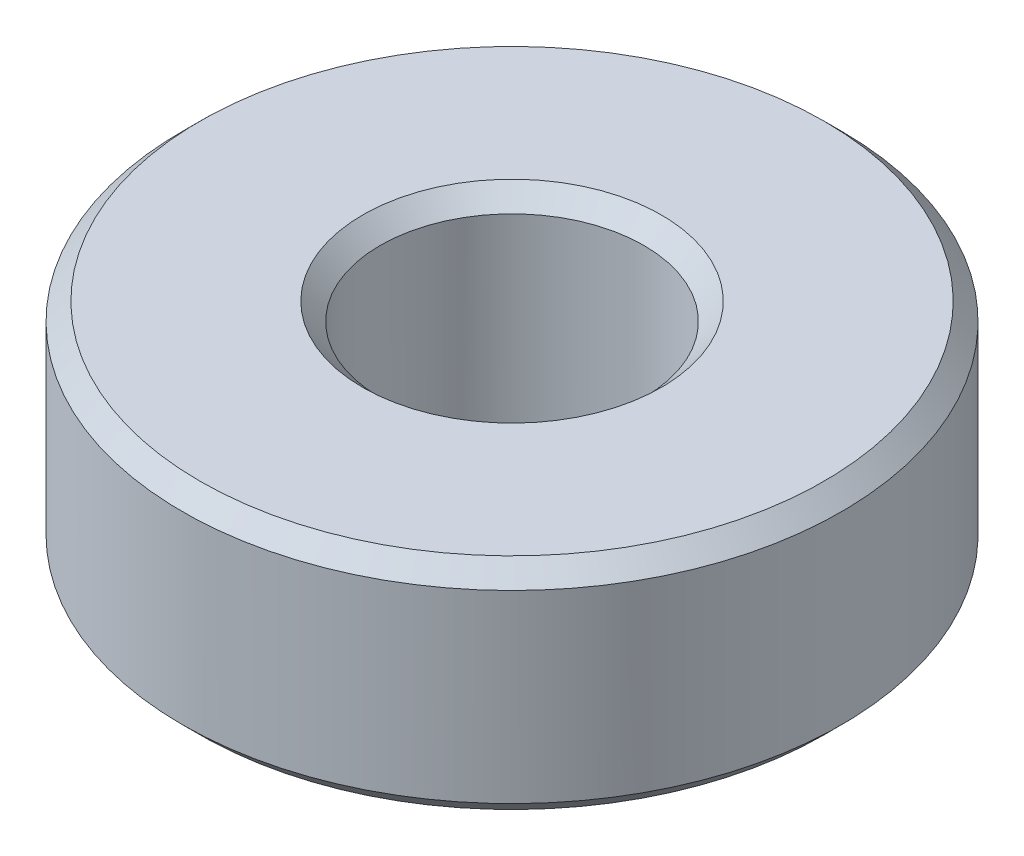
ISO-10303-21;
HEADER;
FILE_DESCRIPTION(('STEP AP214'),'2;1');
FILE_NAME('part.step','',(''),(''),'','','');
FILE_SCHEMA(('AUTOMOTIVE_DESIGN { 1 0 10303 214 1 1 1 1 }'));
ENDSEC;
DATA;
#1=APPLICATION_CONTEXT('core data for automotive mechanical design processes');
#2=APPLICATION_PROTOCOL_DEFINITION('international standard','automotive_design',2000,#1);
#3=PRODUCT_CONTEXT('',#1,'mechanical');
#4=PRODUCT('Part','Part','',(#3));
#5=PRODUCT_RELATED_PRODUCT_CATEGORY('part','',(#4));
#6=PRODUCT_DEFINITION_FORMATION('','',#4);
#7=PRODUCT_DEFINITION_CONTEXT('part definition',#1,'design');
#8=PRODUCT_DEFINITION('design','',#6,#7);
#9=PRODUCT_DEFINITION_SHAPE('','',#8);
#10=(LENGTH_UNIT() NAMED_UNIT(*) SI_UNIT(.MILLI.,.METRE.));
#11=(NAMED_UNIT(*) PLANE_ANGLE_UNIT() SI_UNIT($,.RADIAN.));
#12=(NAMED_UNIT(*) SI_UNIT($,.STERADIAN.) SOLID_ANGLE_UNIT());
#13=UNCERTAINTY_MEASURE_WITH_UNIT(LENGTH_MEASURE(1.E-05),#10,'distance_accuracy_value','');
#14=(GEOMETRIC_REPRESENTATION_CONTEXT(3) GLOBAL_UNCERTAINTY_ASSIGNED_CONTEXT((#13)) GLOBAL_UNIT_ASSIGNED_CONTEXT((#10,
#11,#12)) REPRESENTATION_CONTEXT('',''));
#15=CARTESIAN_POINT('',(0.,0.,0.));
#16=DIRECTION('',(0.,0.,1.));
#17=DIRECTION('',(1.,0.,0.));
#18=AXIS2_PLACEMENT_3D('',#15,#16,#17);
#19=CARTESIAN_POINT('',(0.,5.,0.));
#20=DIRECTION('',(0.,1.,0.));
#21=DIRECTION('',(0.,0.,1.));
#22=AXIS2_PLACEMENT_3D('',#19,#20,#21);
#23=PLANE('',#22);
#24=CARTESIAN_POINT('',(0.,5.,0.));
#25=DIRECTION('',(0.,-1.,0.));
#26=DIRECTION('',(0.,0.,-1.));
#27=AXIS2_PLACEMENT_3D('',#24,#25,#26);
#28=CIRCLE('',#27,7.09999999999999);
#29=CARTESIAN_POINT('',(0.,5.,-7.09999999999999));
#30=VERTEX_POINT('',#29);
#31=EDGE_CURVE('E32',#30,#30,#28,.T.);
#32=ORIENTED_EDGE('',*,*,#31,.F.);
#33=EDGE_LOOP('',(#32));
#34=FACE_BOUND('',#33,.T.);
#35=CARTESIAN_POINT('',(0.,5.0000000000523,0.));
#36=DIRECTION('',(0.,1.,0.));
#37=DIRECTION('',(0.,0.,1.));
#38=AXIS2_PLACEMENT_3D('',#35,#36,#37);
#39=CIRCLE('',#38,3.39999999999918);
#40=CARTESIAN_POINT('',(0.,5.0000000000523,3.39999999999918));
#41=VERTEX_POINT('',#40);
#42=EDGE_CURVE('E18',#41,#41,#39,.F.);
#43=ORIENTED_EDGE('',*,*,#42,.T.);
#44=EDGE_LOOP('',(#43));
#45=FACE_BOUND('',#44,.T.);
#46=ADVANCED_FACE('F15',(#34,#45),#23,.T.);
#47=CARTESIAN_POINT('',(0.,5.0000000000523,0.));
#48=DIRECTION('',(0.,1.,0.));
#49=DIRECTION('',(0.,0.,1.));
#50=AXIS2_PLACEMENT_3D('',#47,#48,#49);
#51=CONICAL_SURFACE('',#50,3.39999999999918,0.785398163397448);
#52=ORIENTED_EDGE('',*,*,#42,.F.);
#53=EDGE_LOOP('',(#52));
#54=FACE_BOUND('',#53,.T.);
#55=CARTESIAN_POINT('',(0.,4.6,0.));
#56=DIRECTION('',(0.,-1.,0.));
#57=DIRECTION('',(0.,0.,-1.));
#58=AXIS2_PLACEMENT_3D('',#55,#56,#57);
#59=CIRCLE('',#58,3.);
#60=CARTESIAN_POINT('',(0.,4.6,-3.));
#61=VERTEX_POINT('',#60);
#62=EDGE_CURVE('E30',#61,#61,#59,.T.);
#63=ORIENTED_EDGE('',*,*,#62,.T.);
#64=EDGE_LOOP('',(#63));
#65=FACE_BOUND('',#64,.T.);
#66=ADVANCED_FACE('F42',(#54,#65),#51,.F.);
#67=CARTESIAN_POINT('',(0.,4.59999999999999,0.));
#68=DIRECTION('',(0.,-1.,0.));
#69=DIRECTION('',(0.,0.,-1.));
#70=AXIS2_PLACEMENT_3D('',#67,#68,#69);
#71=CONICAL_SURFACE('',#70,7.5,0.78539816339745);
#72=ORIENTED_EDGE('',*,*,#31,.T.);
#73=EDGE_LOOP('',(#72));
#74=FACE_BOUND('',#73,.T.);
#75=CARTESIAN_POINT('',(0.,4.59999999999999,0.));
#76=DIRECTION('',(0.,-1.,0.));
#77=DIRECTION('',(0.,0.,-1.));
#78=AXIS2_PLACEMENT_3D('',#75,#76,#77);
#79=CIRCLE('',#78,7.5);
#80=CARTESIAN_POINT('',(0.,4.59999999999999,-7.5));
#81=VERTEX_POINT('',#80);
#82=EDGE_CURVE('E37',#81,#81,#79,.T.);
#83=ORIENTED_EDGE('',*,*,#82,.F.);
#84=EDGE_LOOP('',(#83));
#85=FACE_BOUND('',#84,.T.);
#86=ADVANCED_FACE('F45',(#74,#85),#71,.T.);
#87=CARTESIAN_POINT('',(0.,5.,0.));
#88=DIRECTION('',(0.,-1.,0.));
#89=DIRECTION('',(0.,0.,-1.));
#90=AXIS2_PLACEMENT_3D('',#87,#88,#89);
#91=CYLINDRICAL_SURFACE('',#90,3.);
#92=CARTESIAN_POINT('',(0.,0.400000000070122,0.));
#93=DIRECTION('',(0.,-1.,0.));
#94=DIRECTION('',(0.,0.,-1.));
#95=AXIS2_PLACEMENT_3D('',#92,#93,#94);
#96=CIRCLE('',#95,2.9999999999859);
#97=CARTESIAN_POINT('',(0.,0.400000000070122,-2.9999999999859));
#98=VERTEX_POINT('',#97);
#99=EDGE_CURVE('E81',#98,#98,#96,.T.);
#100=ORIENTED_EDGE('',*,*,#99,.T.);
#101=EDGE_LOOP('',(#100));
#102=FACE_BOUND('',#101,.T.);
#103=ORIENTED_EDGE('',*,*,#62,.F.);
#104=EDGE_LOOP('',(#103));
#105=FACE_BOUND('',#104,.T.);
#106=ADVANCED_FACE('F48',(#102,#105),#91,.F.);
#107=CARTESIAN_POINT('',(0.,5.,0.));
#108=DIRECTION('',(0.,-1.,0.));
#109=DIRECTION('',(0.,0.,-1.));
#110=AXIS2_PLACEMENT_3D('',#107,#108,#109);
#111=CYLINDRICAL_SURFACE('',#110,7.5);
#112=ORIENTED_EDGE('',*,*,#82,.T.);
#113=EDGE_LOOP('',(#112));
#114=FACE_BOUND('',#113,.T.);
#115=CARTESIAN_POINT('',(0.,0.399999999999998,0.));
#116=DIRECTION('',(0.,1.,0.));
#117=DIRECTION('',(0.,0.,1.));
#118=AXIS2_PLACEMENT_3D('',#115,#116,#117);
#119=CIRCLE('',#118,7.5);
#120=CARTESIAN_POINT('',(0.,0.399999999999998,7.5));
#121=VERTEX_POINT('',#120);
#122=EDGE_CURVE('E27',#121,#121,#119,.F.);
#123=ORIENTED_EDGE('',*,*,#122,.F.);
#124=EDGE_LOOP('',(#123));
#125=FACE_BOUND('',#124,.T.);
#126=ADVANCED_FACE('F50',(#114,#125),#111,.T.);
#127=CARTESIAN_POINT('',(0.,5.6843418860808E-11,0.));
#128=DIRECTION('',(0.,-1.,0.));
#129=DIRECTION('',(0.,0.,-1.));
#130=AXIS2_PLACEMENT_3D('',#127,#128,#129);
#131=CONICAL_SURFACE('',#130,3.39999999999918,0.785398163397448);
#132=CARTESIAN_POINT('',(0.,5.6843418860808E-11,0.));
#133=DIRECTION('',(0.,-1.,0.));
#134=DIRECTION('',(0.,0.,-1.));
#135=AXIS2_PLACEMENT_3D('',#132,#133,#134);
#136=CIRCLE('',#135,3.39999999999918);
#137=CARTESIAN_POINT('',(0.,5.6843418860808E-11,-3.39999999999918));
#138=VERTEX_POINT('',#137);
#139=EDGE_CURVE('E22',#138,#138,#136,.T.);
#140=ORIENTED_EDGE('',*,*,#139,.T.);
#141=EDGE_LOOP('',(#140));
#142=FACE_BOUND('',#141,.T.);
#143=ORIENTED_EDGE('',*,*,#99,.F.);
#144=EDGE_LOOP('',(#143));
#145=FACE_BOUND('',#144,.T.);
#146=ADVANCED_FACE('F58',(#142,#145),#131,.F.);
#147=CARTESIAN_POINT('',(0.,0.399999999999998,0.));
#148=DIRECTION('',(0.,1.,0.));
#149=DIRECTION('',(-1.,0.,0.));
#150=AXIS2_PLACEMENT_3D('',#147,#148,#149);
#151=CONICAL_SURFACE('',#150,7.5,0.785398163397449);
#152=CARTESIAN_POINT('',(0.,0.,0.));
#153=DIRECTION('',(0.,1.,0.));
#154=DIRECTION('',(-1.,0.,0.));
#155=AXIS2_PLACEMENT_3D('',#152,#153,#154);
#156=CIRCLE('',#155,7.1);
#157=CARTESIAN_POINT('',(-7.1,0.,0.));
#158=VERTEX_POINT('',#157);
#159=EDGE_CURVE('E10',#158,#158,#156,.T.);
#160=ORIENTED_EDGE('',*,*,#159,.T.);
#161=EDGE_LOOP('',(#160));
#162=FACE_BOUND('',#161,.T.);
#163=ORIENTED_EDGE('',*,*,#122,.T.);
#164=EDGE_LOOP('',(#163));
#165=FACE_BOUND('',#164,.T.);
#166=ADVANCED_FACE('F65',(#162,#165),#151,.T.);
#167=CARTESIAN_POINT('',(0.,0.,0.));
#168=DIRECTION('',(0.,1.,0.));
#169=DIRECTION('',(0.,0.,1.));
#170=AXIS2_PLACEMENT_3D('',#167,#168,#169);
#171=PLANE('',#170);
#172=ORIENTED_EDGE('',*,*,#159,.F.);
#173=EDGE_LOOP('',(#172));
#174=FACE_BOUND('',#173,.T.);
#175=ORIENTED_EDGE('',*,*,#139,.F.);
#176=EDGE_LOOP('',(#175));
#177=FACE_BOUND('',#176,.T.);
#178=ADVANCED_FACE('F63',(#174,#177),#171,.F.);
#179=CLOSED_SHELL('',(#46,#66,#86,#106,#126,#146,#166,#178));
#180=MANIFOLD_SOLID_BREP('B1',#179);
#181=ADVANCED_BREP_SHAPE_REPRESENTATION('',(#18,#180),#14);
#182=SHAPE_DEFINITION_REPRESENTATION(#9,#181);
ENDSEC;
END-ISO-10303-21;
